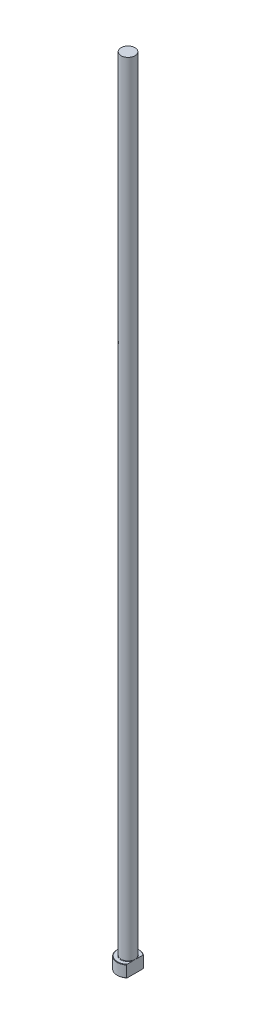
ISO-10303-21;
HEADER;
FILE_DESCRIPTION(('STEP AP214'),'2;1');
FILE_NAME('part.step','',(''),(''),'','','');
FILE_SCHEMA(('AUTOMOTIVE_DESIGN { 1 0 10303 214 1 1 1 1 }'));
ENDSEC;
DATA;
#1=APPLICATION_CONTEXT('core data for automotive mechanical design processes');
#2=APPLICATION_PROTOCOL_DEFINITION('international standard','automotive_design',2000,#1);
#3=PRODUCT_CONTEXT('',#1,'mechanical');
#4=PRODUCT('Part','Part','',(#3));
#5=PRODUCT_RELATED_PRODUCT_CATEGORY('part','',(#4));
#6=PRODUCT_DEFINITION_FORMATION('','',#4);
#7=PRODUCT_DEFINITION_CONTEXT('part definition',#1,'design');
#8=PRODUCT_DEFINITION('design','',#6,#7);
#9=PRODUCT_DEFINITION_SHAPE('','',#8);
#10=(LENGTH_UNIT() NAMED_UNIT(*) SI_UNIT(.MILLI.,.METRE.));
#11=(NAMED_UNIT(*) PLANE_ANGLE_UNIT() SI_UNIT($,.RADIAN.));
#12=(NAMED_UNIT(*) SI_UNIT($,.STERADIAN.) SOLID_ANGLE_UNIT());
#13=UNCERTAINTY_MEASURE_WITH_UNIT(LENGTH_MEASURE(1.E-05),#10,'distance_accuracy_value','');
#14=(GEOMETRIC_REPRESENTATION_CONTEXT(3) GLOBAL_UNCERTAINTY_ASSIGNED_CONTEXT((#13)) GLOBAL_UNIT_ASSIGNED_CONTEXT((#10,
#11,#12)) REPRESENTATION_CONTEXT('',''));
#15=CARTESIAN_POINT('',(0.,0.,0.));
#16=DIRECTION('',(0.,0.,1.));
#17=DIRECTION('',(1.,0.,0.));
#18=AXIS2_PLACEMENT_3D('',#15,#16,#17);
#19=CARTESIAN_POINT('',(0.,0.,0.));
#20=DIRECTION('',(0.,-1.,0.));
#21=DIRECTION('',(0.,0.,-1.));
#22=AXIS2_PLACEMENT_3D('',#19,#20,#21);
#23=PLANE('',#22);
#24=CARTESIAN_POINT('',(0.,0.,0.));
#25=DIRECTION('',(0.,-1.,0.));
#26=DIRECTION('',(0.,0.,-1.));
#27=AXIS2_PLACEMENT_3D('',#24,#25,#26);
#28=CIRCLE('',#27,5.30000000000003);
#29=CARTESIAN_POINT('',(3.49999999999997,0.,3.97994974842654));
#30=VERTEX_POINT('',#29);
#31=CARTESIAN_POINT('',(3.49999999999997,0.,-3.97994974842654));
#32=VERTEX_POINT('',#31);
#33=EDGE_CURVE('E98',#30,#32,#28,.T.);
#34=ORIENTED_EDGE('',*,*,#33,.T.);
#35=DIRECTION('',(0.,0.,1.));
#36=VECTOR('',#35,1.);
#37=CARTESIAN_POINT('',(3.49999999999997,0.,4.24264068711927));
#38=LINE('',#37,#36);
#39=EDGE_CURVE('E83',#32,#30,#38,.T.);
#40=ORIENTED_EDGE('',*,*,#39,.T.);
#41=EDGE_LOOP('',(#34,#40));
#42=FACE_BOUND('',#41,.T.);
#43=ADVANCED_FACE('F32',(#42),#23,.T.);
#44=CARTESIAN_POINT('',(0.,259.958771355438,0.));
#45=DIRECTION('',(0.,1.,0.));
#46=DIRECTION('',(0.,0.,1.));
#47=AXIS2_PLACEMENT_3D('',#44,#45,#46);
#48=CYLINDRICAL_SURFACE('',#47,5.49999999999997);
#49=CARTESIAN_POINT('',(0.,5.80000000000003,0.));
#50=DIRECTION('',(0.,1.,0.));
#51=DIRECTION('',(0.,0.,1.));
#52=AXIS2_PLACEMENT_3D('',#49,#50,#51);
#53=CIRCLE('',#52,5.49999999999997);
#54=CARTESIAN_POINT('',(3.49999999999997,5.80000000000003,4.24264068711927));
#55=VERTEX_POINT('',#54);
#56=CARTESIAN_POINT('',(3.49999999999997,5.80000000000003,-4.24264068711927));
#57=VERTEX_POINT('',#56);
#58=EDGE_CURVE('E104',#55,#57,#53,.F.);
#59=ORIENTED_EDGE('',*,*,#58,.T.);
#60=DIRECTION('',(0.,-1.,0.));
#61=VECTOR('',#60,1.);
#62=CARTESIAN_POINT('',(3.49999999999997,400.,-4.24264068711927));
#63=LINE('',#62,#61);
#64=CARTESIAN_POINT('',(3.49999999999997,0.199999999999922,-4.24264068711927));
#65=VERTEX_POINT('',#64);
#66=EDGE_CURVE('E183',#57,#65,#63,.T.);
#67=ORIENTED_EDGE('',*,*,#66,.T.);
#68=CARTESIAN_POINT('',(0.,0.199999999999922,0.));
#69=DIRECTION('',(0.,-1.,0.));
#70=DIRECTION('',(0.,0.,-1.));
#71=AXIS2_PLACEMENT_3D('',#68,#69,#70);
#72=CIRCLE('',#71,5.49999999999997);
#73=CARTESIAN_POINT('',(3.49999999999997,0.199999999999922,4.24264068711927));
#74=VERTEX_POINT('',#73);
#75=EDGE_CURVE('E100',#65,#74,#72,.F.);
#76=ORIENTED_EDGE('',*,*,#75,.T.);
#77=DIRECTION('',(0.,-1.,0.));
#78=VECTOR('',#77,1.);
#79=CARTESIAN_POINT('',(3.49999999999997,400.,4.24264068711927));
#80=LINE('',#79,#78);
#81=EDGE_CURVE('E93',#55,#74,#80,.T.);
#82=ORIENTED_EDGE('',*,*,#81,.F.);
#83=EDGE_LOOP('',(#59,#67,#76,#82));
#84=FACE_BOUND('',#83,.T.);
#85=ADVANCED_FACE('F158',(#84),#48,.T.);
#86=CARTESIAN_POINT('',(-5.49999999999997,6.,0.));
#87=DIRECTION('',(0.,1.,0.));
#88=DIRECTION('',(0.,0.,1.));
#89=AXIS2_PLACEMENT_3D('',#86,#87,#88);
#90=PLANE('',#89);
#91=CARTESIAN_POINT('',(0.,6.,0.));
#92=DIRECTION('',(0.,1.,0.));
#93=DIRECTION('',(0.,0.,1.));
#94=AXIS2_PLACEMENT_3D('',#91,#92,#93);
#95=CIRCLE('',#94,5.29999999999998);
#96=CARTESIAN_POINT('',(3.49999999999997,6.,-3.97994974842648));
#97=VERTEX_POINT('',#96);
#98=CARTESIAN_POINT('',(3.49999999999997,6.,3.97994974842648));
#99=VERTEX_POINT('',#98);
#100=EDGE_CURVE('E178',#97,#99,#95,.T.);
#101=ORIENTED_EDGE('',*,*,#100,.T.);
#102=DIRECTION('',(0.,0.,-1.));
#103=VECTOR('',#102,1.);
#104=CARTESIAN_POINT('',(3.49999999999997,6.,0.));
#105=LINE('',#104,#103);
#106=CARTESIAN_POINT('',(3.49999999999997,5.99999999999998,1.19999999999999));
#107=VERTEX_POINT('',#106);
#108=EDGE_CURVE('E57',#99,#107,#105,.T.);
#109=ORIENTED_EDGE('',*,*,#108,.T.);
#110=CARTESIAN_POINT('',(0.,6.,0.));
#111=DIRECTION('',(0.,1.,0.));
#112=DIRECTION('',(0.,0.,1.));
#113=AXIS2_PLACEMENT_3D('',#110,#111,#112);
#114=CIRCLE('',#113,3.69999999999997);
#115=CARTESIAN_POINT('',(3.49999999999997,5.99999999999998,-1.19999999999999));
#116=VERTEX_POINT('',#115);
#117=EDGE_CURVE('E107',#107,#116,#114,.F.);
#118=ORIENTED_EDGE('',*,*,#117,.T.);
#119=EDGE_CURVE('E136',#116,#97,#105,.T.);
#120=ORIENTED_EDGE('',*,*,#119,.T.);
#121=EDGE_LOOP('',(#101,#109,#118,#120));
#122=FACE_BOUND('',#121,.T.);
#123=ADVANCED_FACE('F147',(#122),#90,.T.);
#124=CARTESIAN_POINT('',(0.,6.00000000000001,0.));
#125=DIRECTION('',(0.,-1.,0.));
#126=DIRECTION('',(0.,0.,-1.));
#127=AXIS2_PLACEMENT_3D('',#124,#125,#126);
#128=CONICAL_SURFACE('',#127,5.29999999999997,0.785398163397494);
#129=ORIENTED_EDGE('',*,*,#58,.F.);
#130=CARTESIAN_POINT('',(3.49999999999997,1.33003849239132,9.33542352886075));
#131=CARTESIAN_POINT('',(3.49999999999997,1.46606755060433,9.19014587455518));
#132=CARTESIAN_POINT('',(3.49999999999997,1.60189091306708,9.04467563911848));
#133=CARTESIAN_POINT('',(3.49999999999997,1.87305939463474,8.75328845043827));
#134=CARTESIAN_POINT('',(3.49999999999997,2.00840451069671,8.60737149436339));
#135=CARTESIAN_POINT('',(3.49999999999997,2.41368868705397,8.16878624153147));
#136=CARTESIAN_POINT('',(3.49999999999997,2.68280695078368,7.87535778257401));
#137=CARTESIAN_POINT('',(3.49999999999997,3.22029202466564,7.28335275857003));
#138=CARTESIAN_POINT('',(3.49999999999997,3.4886340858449,6.9847536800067));
#139=CARTESIAN_POINT('',(3.49999999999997,4.02101445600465,6.38381794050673));
#140=CARTESIAN_POINT('',(3.49999999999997,4.28505346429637,6.08148190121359));
#141=CARTESIAN_POINT('',(3.49999999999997,4.76064644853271,5.52540485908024));
#142=CARTESIAN_POINT('',(3.49999999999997,4.97321621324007,5.27253724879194));
#143=CARTESIAN_POINT('',(3.49999999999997,5.28746532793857,4.88936279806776));
#144=CARTESIAN_POINT('',(3.49999999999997,5.39146981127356,4.76096380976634));
#145=CARTESIAN_POINT('',(3.49999999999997,5.5975686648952,4.50264388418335));
#146=CARTESIAN_POINT('',(3.49999999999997,5.69966308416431,4.3727229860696));
#147=CARTESIAN_POINT('',(3.49999999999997,5.90129005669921,4.11132273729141));
#148=CARTESIAN_POINT('',(3.49999999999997,6.00082737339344,3.97984706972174));
#149=CARTESIAN_POINT('',(3.49999999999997,6.19694716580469,3.71471559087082));
#150=CARTESIAN_POINT('',(3.49999999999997,6.29352983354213,3.58105992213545));
#151=CARTESIAN_POINT('',(3.49999999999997,6.48287386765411,3.31118530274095));
#152=CARTESIAN_POINT('',(3.49999999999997,6.57563763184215,3.17496804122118));
#153=CARTESIAN_POINT('',(3.49999999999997,6.75628267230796,2.89934683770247));
#154=CARTESIAN_POINT('',(3.49999999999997,6.84416488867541,2.75994351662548));
#155=CARTESIAN_POINT('',(3.49999999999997,6.99814457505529,2.50290457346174));
#156=CARTESIAN_POINT('',(3.49999999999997,7.06530217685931,2.3859068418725));
#157=CARTESIAN_POINT('',(3.49999999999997,7.19416460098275,2.14890235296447));
#158=CARTESIAN_POINT('',(3.49999999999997,7.25586874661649,2.02889522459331));
#159=CARTESIAN_POINT('',(3.49999999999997,7.37226286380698,1.78564087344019));
#160=CARTESIAN_POINT('',(3.49999999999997,7.42695969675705,1.66239696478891));
#161=CARTESIAN_POINT('',(3.49999999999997,7.52751976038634,1.41233625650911));
#162=CARTESIAN_POINT('',(3.49999999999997,7.57338548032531,1.28552047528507));
#163=CARTESIAN_POINT('',(3.49999999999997,7.64556102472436,1.05555158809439));
#164=CARTESIAN_POINT('',(3.49999999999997,7.67395518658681,0.953056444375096));
#165=CARTESIAN_POINT('',(3.49999999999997,7.72275092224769,0.7461912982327));
#166=CARTESIAN_POINT('',(3.49999999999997,7.7431553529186,0.641821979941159));
#167=CARTESIAN_POINT('',(3.49999999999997,7.77495944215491,0.43200211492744));
#168=CARTESIAN_POINT('',(3.49999999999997,7.78638437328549,0.326555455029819));
#169=CARTESIAN_POINT('',(3.49999999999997,7.79969943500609,0.115055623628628));
#170=CARTESIAN_POINT('',(3.49999999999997,7.80158992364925,0.00900247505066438));
#171=CARTESIAN_POINT('',(3.49999999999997,7.79572329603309,-0.202966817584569));
#172=CARTESIAN_POINT('',(3.49999999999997,7.78795394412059,-0.308882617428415));
#173=CARTESIAN_POINT('',(3.49999999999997,7.76318672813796,-0.519620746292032));
#174=CARTESIAN_POINT('',(3.49999999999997,7.74618811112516,-0.62444298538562));
#175=CARTESIAN_POINT('',(3.49999999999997,7.7037631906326,-0.832676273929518));
#176=CARTESIAN_POINT('',(3.49999999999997,7.67831139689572,-0.936082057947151));
#177=CARTESIAN_POINT('',(3.49999999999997,7.62008719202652,-1.14078653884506));
#178=CARTESIAN_POINT('',(3.49999999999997,7.58731462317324,-1.24208519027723));
#179=CARTESIAN_POINT('',(3.49999999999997,7.50935793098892,-1.45980073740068));
#180=CARTESIAN_POINT('',(3.49999999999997,7.46300722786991,-1.5757969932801));
#181=CARTESIAN_POINT('',(3.49999999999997,7.36341881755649,-1.80480236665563));
#182=CARTESIAN_POINT('',(3.49999999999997,7.31017881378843,-1.91781047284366));
#183=CARTESIAN_POINT('',(3.49999999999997,7.19809800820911,-2.14125149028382));
#184=CARTESIAN_POINT('',(3.49999999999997,7.13924715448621,-2.25167932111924));
#185=CARTESIAN_POINT('',(3.49999999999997,7.01714037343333,-2.47003557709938));
#186=CARTESIAN_POINT('',(3.49999999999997,6.95388506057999,-2.57796434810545));
#187=CARTESIAN_POINT('',(3.49999999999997,6.82298676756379,-2.79303108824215));
#188=CARTESIAN_POINT('',(3.49999999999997,6.75529770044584,-2.90014087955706));
#189=CARTESIAN_POINT('',(3.49999999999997,6.61696954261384,-3.11243359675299));
#190=CARTESIAN_POINT('',(3.49999999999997,6.54633037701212,-3.21761647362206));
#191=CARTESIAN_POINT('',(3.49999999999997,6.33097773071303,-3.53046033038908));
#192=CARTESIAN_POINT('',(3.49999999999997,6.18268185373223,-3.73565296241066));
#193=CARTESIAN_POINT('',(3.49999999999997,5.84686519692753,-4.18490965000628));
#194=CARTESIAN_POINT('',(3.49999999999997,5.65778936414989,-4.42779920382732));
#195=CARTESIAN_POINT('',(3.49999999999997,5.27320376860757,-4.90845921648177));
#196=CARTESIAN_POINT('',(3.49999999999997,5.07769298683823,-5.14622885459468));
#197=CARTESIAN_POINT('',(3.49999999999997,4.68199594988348,-5.61823063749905));
#198=CARTESIAN_POINT('',(3.49999999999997,4.48180526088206,-5.85245905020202));
#199=CARTESIAN_POINT('',(3.49999999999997,4.07816705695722,-6.31809464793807));
#200=CARTESIAN_POINT('',(3.49999999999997,3.87471946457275,-6.54950176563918));
#201=CARTESIAN_POINT('',(3.49999999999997,3.4780510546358,-6.99590528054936));
#202=CARTESIAN_POINT('',(3.49999999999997,3.2849759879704,-7.21103144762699));
#203=CARTESIAN_POINT('',(3.49999999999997,2.8971523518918,-7.63977694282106));
#204=CARTESIAN_POINT('',(3.49999999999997,2.70240374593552,-7.85339623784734));
#205=CARTESIAN_POINT('',(3.49999999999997,2.31198639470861,-8.27898344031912));
#206=CARTESIAN_POINT('',(3.49999999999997,2.11632036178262,-8.49095383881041));
#207=CARTESIAN_POINT('',(3.49999999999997,1.72392141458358,-8.91388826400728));
#208=CARTESIAN_POINT('',(3.49999999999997,1.52718854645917,-9.1248523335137));
#209=CARTESIAN_POINT('',(3.49999999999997,1.33003849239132,-9.33542352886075));
#210=B_SPLINE_CURVE_WITH_KNOTS('',3,(#130,#131,#132,#133,#134,#135,#136,#137,#138,#139,#140,
#141,#142,#143,#144,#145,#146,#147,#148,#149,#150,#151,#152,#153,#154,#155,#156,#157,#158,#159,
#160,#161,#162,#163,#164,#165,#166,#167,#168,#169,#170,#171,#172,#173,#174,#175,#176,#177,#178,
#179,#180,#181,#182,#183,#184,#185,#186,#187,#188,#189,#190,#191,#192,#193,#194,#195,#196,#197,
#198,#199,#200,#201,#202,#203,#204,#205,#206,#207,#208,#209),.UNSPECIFIED.,.F.,.F.,(4,2,2,2,2,2,
2,2,2,2,2,2,2,2,2,2,2,2,2,2,2,2,2,2,2,2,2,2,2,2,2,2,2,2,2,2,2,2,2,4),(0.,0.597063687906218,
1.19413116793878,2.38857142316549,3.59291920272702,4.79706926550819,5.78802649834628,
6.28372320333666,6.77940717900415,7.27408870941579,7.76873802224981,8.26307186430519,
8.75731017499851,9.16190479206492,9.56654954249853,9.97079499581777,10.3749263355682,
10.6937207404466,11.0124010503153,11.3301811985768,11.647949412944,11.9661205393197,
12.2843176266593,12.6034830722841,12.9226553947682,13.2971137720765,13.6716972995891,
14.0469649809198,14.4221804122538,14.8022378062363,15.1823048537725,15.9416042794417,
16.8648705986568,17.7882838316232,18.7126105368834,19.6369592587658,20.5041367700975,
21.37133326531,22.2367481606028,23.1021259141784),.UNSPECIFIED.);
#211=EDGE_CURVE('E135',#55,#99,#210,.T.);
#212=ORIENTED_EDGE('',*,*,#211,.T.);
#213=ORIENTED_EDGE('',*,*,#100,.F.);
#214=EDGE_CURVE('E127',#97,#57,#210,.T.);
#215=ORIENTED_EDGE('',*,*,#214,.T.);
#216=EDGE_LOOP('',(#129,#212,#213,#215));
#217=FACE_BOUND('',#216,.T.);
#218=ADVANCED_FACE('F143',(#217),#128,.T.);
#219=CARTESIAN_POINT('',(0.,0.199999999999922,0.));
#220=DIRECTION('',(0.,1.,0.));
#221=DIRECTION('',(0.,0.,1.));
#222=AXIS2_PLACEMENT_3D('',#219,#220,#221);
#223=CONICAL_SURFACE('',#222,5.49999999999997,0.785398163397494);
#224=ORIENTED_EDGE('',*,*,#75,.F.);
#225=CARTESIAN_POINT('',(3.49999999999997,4.66996150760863,-9.33542352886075));
#226=CARTESIAN_POINT('',(3.49999999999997,4.53393244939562,-9.19014587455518));
#227=CARTESIAN_POINT('',(3.49999999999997,4.39810908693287,-9.04467563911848));
#228=CARTESIAN_POINT('',(3.49999999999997,4.12694060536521,-8.75328845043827));
#229=CARTESIAN_POINT('',(3.49999999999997,3.99159548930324,-8.60737149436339));
#230=CARTESIAN_POINT('',(3.49999999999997,3.58631131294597,-8.16878624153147));
#231=CARTESIAN_POINT('',(3.49999999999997,3.31719304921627,-7.87535778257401));
#232=CARTESIAN_POINT('',(3.49999999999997,2.77970797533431,-7.28335275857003));
#233=CARTESIAN_POINT('',(3.49999999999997,2.51136591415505,-6.9847536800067));
#234=CARTESIAN_POINT('',(3.49999999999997,1.97898554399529,-6.38381794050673));
#235=CARTESIAN_POINT('',(3.49999999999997,1.71494653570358,-6.08148190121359));
#236=CARTESIAN_POINT('',(3.49999999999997,1.23935355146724,-5.52540485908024));
#237=CARTESIAN_POINT('',(3.49999999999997,1.02678378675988,-5.27253724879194));
#238=CARTESIAN_POINT('',(3.49999999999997,0.712534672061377,-4.88936279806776));
#239=CARTESIAN_POINT('',(3.49999999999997,0.608530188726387,-4.76096380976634));
#240=CARTESIAN_POINT('',(3.49999999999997,0.402431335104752,-4.50264388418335));
#241=CARTESIAN_POINT('',(3.49999999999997,0.300336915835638,-4.3727229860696));
#242=CARTESIAN_POINT('',(3.49999999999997,0.0987099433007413,-4.11132273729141));
#243=CARTESIAN_POINT('',(3.49999999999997,-0.000827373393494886,-3.97984706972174));
#244=CARTESIAN_POINT('',(3.49999999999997,-0.196947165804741,-3.71471559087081));
#245=CARTESIAN_POINT('',(3.49999999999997,-0.293529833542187,-3.58105992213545));
#246=CARTESIAN_POINT('',(3.49999999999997,-0.482873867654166,-3.31118530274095));
#247=CARTESIAN_POINT('',(3.49999999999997,-0.575637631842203,-3.17496804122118));
#248=CARTESIAN_POINT('',(3.49999999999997,-0.756282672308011,-2.89934683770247));
#249=CARTESIAN_POINT('',(3.49999999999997,-0.844164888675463,-2.75994351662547));
#250=CARTESIAN_POINT('',(3.49999999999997,-0.998144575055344,-2.50290457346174));
#251=CARTESIAN_POINT('',(3.49999999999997,-1.06530217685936,-2.38590684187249));
#252=CARTESIAN_POINT('',(3.49999999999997,-1.1941646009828,-2.14890235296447));
#253=CARTESIAN_POINT('',(3.49999999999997,-1.25586874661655,-2.0288952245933));
#254=CARTESIAN_POINT('',(3.49999999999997,-1.37226286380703,-1.78564087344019));
#255=CARTESIAN_POINT('',(3.49999999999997,-1.42695969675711,-1.66239696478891));
#256=CARTESIAN_POINT('',(3.49999999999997,-1.52751976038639,-1.4123362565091));
#257=CARTESIAN_POINT('',(3.49999999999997,-1.57338548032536,-1.28552047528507));
#258=CARTESIAN_POINT('',(3.49999999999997,-1.64556102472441,-1.05555158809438));
#259=CARTESIAN_POINT('',(3.49999999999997,-1.67395518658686,-0.953056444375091));
#260=CARTESIAN_POINT('',(3.49999999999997,-1.72275092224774,-0.746191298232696));
#261=CARTESIAN_POINT('',(3.49999999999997,-1.74315535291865,-0.641821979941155));
#262=CARTESIAN_POINT('',(3.49999999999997,-1.77495944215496,-0.432002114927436));
#263=CARTESIAN_POINT('',(3.49999999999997,-1.78638437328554,-0.326555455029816));
#264=CARTESIAN_POINT('',(3.49999999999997,-1.79969943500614,-0.115055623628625));
#265=CARTESIAN_POINT('',(3.49999999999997,-1.8015899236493,-0.00900247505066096));
#266=CARTESIAN_POINT('',(3.49999999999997,-1.79572329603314,0.202966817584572));
#267=CARTESIAN_POINT('',(3.49999999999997,-1.78795394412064,0.308882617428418));
#268=CARTESIAN_POINT('',(3.49999999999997,-1.76318672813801,0.519620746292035));
#269=CARTESIAN_POINT('',(3.49999999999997,-1.74618811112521,0.624442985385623));
#270=CARTESIAN_POINT('',(3.49999999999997,-1.70376319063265,0.83267627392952));
#271=CARTESIAN_POINT('',(3.49999999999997,-1.67831139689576,0.936082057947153));
#272=CARTESIAN_POINT('',(3.49999999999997,-1.62008719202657,1.14078653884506));
#273=CARTESIAN_POINT('',(3.49999999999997,-1.58731462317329,1.24208519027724));
#274=CARTESIAN_POINT('',(3.49999999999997,-1.50935793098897,1.45980073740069));
#275=CARTESIAN_POINT('',(3.49999999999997,-1.46300722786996,1.5757969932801));
#276=CARTESIAN_POINT('',(3.49999999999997,-1.36341881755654,1.80480236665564));
#277=CARTESIAN_POINT('',(3.49999999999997,-1.31017881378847,1.91781047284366));
#278=CARTESIAN_POINT('',(3.49999999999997,-1.19809800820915,2.14125149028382));
#279=CARTESIAN_POINT('',(3.49999999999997,-1.13924715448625,2.25167932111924));
#280=CARTESIAN_POINT('',(3.49999999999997,-1.01714037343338,2.47003557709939));
#281=CARTESIAN_POINT('',(3.49999999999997,-0.953885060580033,2.57796434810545));
#282=CARTESIAN_POINT('',(3.49999999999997,-0.822986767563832,2.79303108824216));
#283=CARTESIAN_POINT('',(3.49999999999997,-0.755297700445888,2.90014087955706));
#284=CARTESIAN_POINT('',(3.49999999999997,-0.616969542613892,3.112433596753));
#285=CARTESIAN_POINT('',(3.49999999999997,-0.546330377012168,3.21761647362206));
#286=CARTESIAN_POINT('',(3.49999999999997,-0.330977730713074,3.53046033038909));
#287=CARTESIAN_POINT('',(3.49999999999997,-0.182681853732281,3.73565296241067));
#288=CARTESIAN_POINT('',(3.49999999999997,0.153134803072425,4.18490965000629));
#289=CARTESIAN_POINT('',(3.49999999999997,0.342210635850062,4.42779920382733));
#290=CARTESIAN_POINT('',(3.49999999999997,0.726796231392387,4.90845921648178));
#291=CARTESIAN_POINT('',(3.49999999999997,0.922307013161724,5.14622885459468));
#292=CARTESIAN_POINT('',(3.49999999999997,1.31800405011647,5.61823063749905));
#293=CARTESIAN_POINT('',(3.49999999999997,1.5181947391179,5.85245905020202));
#294=CARTESIAN_POINT('',(3.49999999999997,1.92183294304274,6.31809464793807));
#295=CARTESIAN_POINT('',(3.49999999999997,2.1252805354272,6.54950176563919));
#296=CARTESIAN_POINT('',(3.49999999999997,2.52194894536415,6.99590528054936));
#297=CARTESIAN_POINT('',(3.49999999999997,2.71502401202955,7.21103144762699));
#298=CARTESIAN_POINT('',(3.49999999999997,3.10284764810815,7.63977694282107));
#299=CARTESIAN_POINT('',(3.49999999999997,3.29759625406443,7.85339623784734));
#300=CARTESIAN_POINT('',(3.49999999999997,3.68801360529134,8.27898344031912));
#301=CARTESIAN_POINT('',(3.49999999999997,3.88367963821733,8.49095383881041));
#302=CARTESIAN_POINT('',(3.49999999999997,4.27607858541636,8.91388826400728));
#303=CARTESIAN_POINT('',(3.49999999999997,4.47281145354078,9.1248523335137));
#304=CARTESIAN_POINT('',(3.49999999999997,4.66996150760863,9.33542352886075));
#305=B_SPLINE_CURVE_WITH_KNOTS('',3,(#225,#226,#227,#228,#229,#230,#231,#232,#233,#234,#235,
#236,#237,#238,#239,#240,#241,#242,#243,#244,#245,#246,#247,#248,#249,#250,#251,#252,#253,#254,
#255,#256,#257,#258,#259,#260,#261,#262,#263,#264,#265,#266,#267,#268,#269,#270,#271,#272,#273,
#274,#275,#276,#277,#278,#279,#280,#281,#282,#283,#284,#285,#286,#287,#288,#289,#290,#291,#292,
#293,#294,#295,#296,#297,#298,#299,#300,#301,#302,#303,#304),.UNSPECIFIED.,.F.,.F.,(4,2,2,2,2,2,
2,2,2,2,2,2,2,2,2,2,2,2,2,2,2,2,2,2,2,2,2,2,2,2,2,2,2,2,2,2,2,2,2,4),(0.,0.597063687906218,
1.19413116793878,2.38857142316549,3.59291920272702,4.79706926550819,5.78802649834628,
6.28372320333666,6.77940717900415,7.27408870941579,7.76873802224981,8.26307186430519,
8.75731017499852,9.16190479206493,9.56654954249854,9.97079499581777,10.3749263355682,
10.6937207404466,11.0124010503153,11.3301811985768,11.6479494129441,11.9661205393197,
12.2843176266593,12.6034830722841,12.9226553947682,13.2971137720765,13.6716972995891,
14.0469649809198,14.4221804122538,14.8022378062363,15.1823048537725,15.9416042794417,
16.8648705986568,17.7882838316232,18.7126105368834,19.6369592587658,20.5041367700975,
21.37133326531,22.2367481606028,23.1021259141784),.UNSPECIFIED.);
#306=EDGE_CURVE('E86',#65,#32,#305,.T.);
#307=ORIENTED_EDGE('',*,*,#306,.T.);
#308=ORIENTED_EDGE('',*,*,#33,.F.);
#309=EDGE_CURVE('E89',#30,#74,#305,.T.);
#310=ORIENTED_EDGE('',*,*,#309,.T.);
#311=EDGE_LOOP('',(#224,#307,#308,#310));
#312=FACE_BOUND('',#311,.T.);
#313=ADVANCED_FACE('F97',(#312),#223,.T.);
#314=CARTESIAN_POINT('',(0.,6.19999999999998,0.));
#315=DIRECTION('',(0.,1.,0.));
#316=DIRECTION('',(0.,0.,1.));
#317=AXIS2_PLACEMENT_3D('',#314,#315,#316);
#318=TOROIDAL_SURFACE('',#317,3.69999999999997,0.2);
#319=CARTESIAN_POINT('',(3.49999999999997,6.19999999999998,0.));
#320=CARTESIAN_POINT('',(3.49999999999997,6.20000050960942,9.98096063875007E-11));
#321=CARTESIAN_POINT('',(3.49999999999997,6.20000101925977,-2.13486746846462E-07));
#322=CARTESIAN_POINT('',(3.49999999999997,6.20000196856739,-7.95759128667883E-07));
#323=CARTESIAN_POINT('',(3.49999999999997,6.20000239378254,-1.1792583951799E-06));
#324=CARTESIAN_POINT('',(3.49999999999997,6.20000328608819,-2.10014972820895E-06));
#325=CARTESIAN_POINT('',(3.49999999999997,6.20000373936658,-2.65249908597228E-06));
#326=CARTESIAN_POINT('',(3.49999999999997,6.20000454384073,-3.79112889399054E-06));
#327=CARTESIAN_POINT('',(3.49999999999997,6.20000489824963,-4.37533521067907E-06));
#328=CARTESIAN_POINT('',(3.49999999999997,6.20000623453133,-6.66270059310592E-06));
#329=CARTESIAN_POINT('',(3.49999999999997,6.20000714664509,-8.40961025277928E-06));
#330=CARTESIAN_POINT('',(3.49999999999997,6.20000862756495,-1.18496824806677E-05));
#331=CARTESIAN_POINT('',(3.49999999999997,6.2000092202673,-1.35329548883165E-05));
#332=CARTESIAN_POINT('',(3.49999999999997,6.20001174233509,-2.07268950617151E-05));
#333=CARTESIAN_POINT('',(3.49999999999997,6.2000136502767,-2.62477536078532E-05));
#334=CARTESIAN_POINT('',(3.49999999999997,6.20001642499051,-3.66274572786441E-05));
#335=CARTESIAN_POINT('',(3.49999999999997,6.20001740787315,-4.14549355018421E-05));
#336=CARTESIAN_POINT('',(3.49999999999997,6.20002462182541,-7.75352102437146E-05));
#337=CARTESIAN_POINT('',(3.49999999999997,6.20003014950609,-0.000108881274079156));
#338=CARTESIAN_POINT('',(3.49999999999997,6.20005434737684,-0.000233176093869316));
#339=CARTESIAN_POINT('',(3.49999999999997,6.20007737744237,-0.000325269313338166));
#340=CARTESIAN_POINT('',(3.49999999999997,6.200167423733,-0.000691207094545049));
#341=CARTESIAN_POINT('',(3.49999999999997,6.20023166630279,-0.000965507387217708));
#342=CARTESIAN_POINT('',(3.49999999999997,6.20048971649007,-0.00205944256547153));
#343=CARTESIAN_POINT('',(3.49999999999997,6.20068705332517,-0.00287847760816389));
#344=CARTESIAN_POINT('',(3.49999999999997,6.20150941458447,-0.00630050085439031));
#345=CARTESIAN_POINT('',(3.49999999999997,6.2021299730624,-0.00890424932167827));
#346=CARTESIAN_POINT('',(3.49999999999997,6.20703918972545,-0.0294912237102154));
#347=CARTESIAN_POINT('',(3.49999999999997,6.21134300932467,-0.0474719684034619));
#348=CARTESIAN_POINT('',(3.49999999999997,6.21975360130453,-0.0827191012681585));
#349=CARTESIAN_POINT('',(3.49999999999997,6.22386136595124,-0.0999852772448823));
#350=CARTESIAN_POINT('',(3.49999999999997,6.23724019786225,-0.1564055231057));
#351=CARTESIAN_POINT('',(3.49999999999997,6.24645854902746,-0.195572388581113));
#352=CARTESIAN_POINT('',(3.49999999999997,6.26203234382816,-0.262828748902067));
#353=CARTESIAN_POINT('',(3.49999999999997,6.26845671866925,-0.2909022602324));
#354=CARTESIAN_POINT('',(3.49999999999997,6.28094671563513,-0.346379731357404));
#355=CARTESIAN_POINT('',(3.49999999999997,6.28701730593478,-0.373782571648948));
#356=CARTESIAN_POINT('',(3.49999999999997,6.30077691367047,-0.437211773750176));
#357=CARTESIAN_POINT('',(3.49999999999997,6.3083789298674,-0.473257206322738));
#358=CARTESIAN_POINT('',(3.49999999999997,6.32309409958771,-0.545736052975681));
#359=CARTESIAN_POINT('',(3.49999999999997,6.33020304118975,-0.582170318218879));
#360=CARTESIAN_POINT('',(3.49999999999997,6.35161649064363,-0.697757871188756));
#361=CARTESIAN_POINT('',(3.49999999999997,6.36463967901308,-0.777158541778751));
#362=CARTESIAN_POINT('',(3.49999999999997,6.3843837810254,-0.92756184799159));
#363=CARTESIAN_POINT('',(3.49999999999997,6.39165512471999,-0.998486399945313));
#364=CARTESIAN_POINT('',(3.49999999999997,6.3979989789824,-1.10437287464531));
#365=CARTESIAN_POINT('',(3.49999999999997,6.39936233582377,-1.13919451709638));
#366=CARTESIAN_POINT('',(3.49999999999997,6.40028946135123,-1.20885098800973));
#367=CARTESIAN_POINT('',(3.49999999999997,6.39985418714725,-1.24368579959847));
#368=CARTESIAN_POINT('',(3.49999999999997,6.39686573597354,-1.30963279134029));
#369=CARTESIAN_POINT('',(3.49999999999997,6.39453835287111,-1.34075403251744));
#370=CARTESIAN_POINT('',(3.49999999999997,6.38750048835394,-1.40298456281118));
#371=CARTESIAN_POINT('',(3.49999999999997,6.38277118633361,-1.43409178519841));
#372=CARTESIAN_POINT('',(3.49999999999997,6.37000596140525,-1.49609278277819));
#373=CARTESIAN_POINT('',(3.49999999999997,6.36193044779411,-1.52697933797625));
#374=CARTESIAN_POINT('',(3.49999999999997,6.34614337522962,-1.57192957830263));
#375=CARTESIAN_POINT('',(3.49999999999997,6.3402919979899,-1.5866404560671));
#376=CARTESIAN_POINT('',(3.49999999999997,6.32701491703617,-1.6153215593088));
#377=CARTESIAN_POINT('',(3.49999999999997,6.31959341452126,-1.6292936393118));
#378=CARTESIAN_POINT('',(3.49999999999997,6.30547056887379,-1.65150372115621));
#379=CARTESIAN_POINT('',(3.49999999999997,6.29934759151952,-1.6601058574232));
#380=CARTESIAN_POINT('',(3.49999999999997,6.28595656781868,-1.67637400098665));
#381=CARTESIAN_POINT('',(3.49999999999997,6.27869146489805,-1.68404232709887));
#382=CARTESIAN_POINT('',(3.49999999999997,6.26587375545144,-1.69518467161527));
#383=CARTESIAN_POINT('',(3.49999999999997,6.26073958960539,-1.69913647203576));
#384=CARTESIAN_POINT('',(3.49999999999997,6.24994100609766,-1.70624293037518));
#385=CARTESIAN_POINT('',(3.49999999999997,6.24427723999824,-1.70939855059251));
#386=CARTESIAN_POINT('',(3.49999999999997,6.23351378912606,-1.71418736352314));
#387=CARTESIAN_POINT('',(3.49999999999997,6.22849079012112,-1.71599090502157));
#388=CARTESIAN_POINT('',(3.49999999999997,6.21821361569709,-1.71873268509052));
#389=CARTESIAN_POINT('',(3.49999999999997,6.21295968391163,-1.71967181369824));
#390=CARTESIAN_POINT('',(3.49999999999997,6.20234462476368,-1.72059432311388));
#391=CARTESIAN_POINT('',(3.49999999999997,6.19698314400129,-1.72057373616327));
#392=CARTESIAN_POINT('',(3.49999999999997,6.18635093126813,-1.71956893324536));
#393=CARTESIAN_POINT('',(3.49999999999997,6.18108024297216,-1.71858426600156));
#394=CARTESIAN_POINT('',(3.49999999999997,6.17106869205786,-1.71582968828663));
#395=CARTESIAN_POINT('',(3.49999999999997,6.16631466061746,-1.71410641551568));
#396=CARTESIAN_POINT('',(3.49999999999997,6.15709718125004,-1.71001459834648));
#397=CARTESIAN_POINT('',(3.49999999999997,6.15263381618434,-1.70764587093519));
#398=CARTESIAN_POINT('',(3.49999999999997,6.14110717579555,-1.70060771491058));
#399=CARTESIAN_POINT('',(3.49999999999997,6.13433222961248,-1.69546710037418));
#400=CARTESIAN_POINT('',(3.49999999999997,6.12164557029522,-1.68420869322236));
#401=CARTESIAN_POINT('',(3.49999999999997,6.11573697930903,-1.67808752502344));
#402=CARTESIAN_POINT('',(3.49999999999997,6.10028952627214,-1.66008531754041));
#403=CARTESIAN_POINT('',(3.49999999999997,6.09159238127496,-1.64748936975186));
#404=CARTESIAN_POINT('',(3.49999999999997,6.07604019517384,-1.62125022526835));
#405=CARTESIAN_POINT('',(3.49999999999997,6.06918749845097,-1.60760572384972));
#406=CARTESIAN_POINT('',(3.49999999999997,6.05635908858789,-1.57851190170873));
#407=CARTESIAN_POINT('',(3.49999999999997,6.05050870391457,-1.56300807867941));
#408=CARTESIAN_POINT('',(3.49999999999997,6.04009412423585,-1.53156759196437));
#409=CARTESIAN_POINT('',(3.49999999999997,6.03553147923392,-1.51563043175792));
#410=CARTESIAN_POINT('',(3.49999999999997,6.02331191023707,-1.46712048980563));
#411=CARTESIAN_POINT('',(3.49999999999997,6.01724153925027,-1.4341495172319));
#412=CARTESIAN_POINT('',(3.49999999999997,6.00883071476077,-1.37348993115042));
#413=CARTESIAN_POINT('',(3.49999999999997,6.00603148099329,-1.34585663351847));
#414=CARTESIAN_POINT('',(3.49999999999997,6.00204762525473,-1.29046925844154));
#415=CARTESIAN_POINT('',(3.49999999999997,6.00086336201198,-1.26271515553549));
#416=CARTESIAN_POINT('',(3.49999999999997,5.99925913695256,-1.17922229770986));
#417=CARTESIAN_POINT('',(3.49999999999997,6.00080993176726,-1.1234488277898));
#418=CARTESIAN_POINT('',(3.49999999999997,6.00738569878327,-1.01528124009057));
#419=CARTESIAN_POINT('',(3.49999999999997,6.01221131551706,-0.962872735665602));
#420=CARTESIAN_POINT('',(3.49999999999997,6.02425367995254,-0.858750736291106));
#421=CARTESIAN_POINT('',(3.49999999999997,6.03145152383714,-0.807035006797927));
#422=CARTESIAN_POINT('',(3.49999999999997,6.04786442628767,-0.702500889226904));
#423=CARTESIAN_POINT('',(3.49999999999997,6.05712869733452,-0.649690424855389));
#424=CARTESIAN_POINT('',(3.49999999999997,6.07730630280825,-0.542969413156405));
#425=CARTESIAN_POINT('',(3.49999999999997,6.08825618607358,-0.489065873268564));
#426=CARTESIAN_POINT('',(3.49999999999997,6.10770336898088,-0.397738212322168));
#427=CARTESIAN_POINT('',(3.49999999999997,6.11594150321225,-0.360258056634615));
#428=CARTESIAN_POINT('',(3.49999999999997,6.13268124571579,-0.285797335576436));
#429=CARTESIAN_POINT('',(3.49999999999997,6.14117887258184,-0.248815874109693));
#430=CARTESIAN_POINT('',(3.49999999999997,6.15740628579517,-0.179140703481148));
#431=CARTESIAN_POINT('',(3.49999999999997,6.16511243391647,-0.146441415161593));
#432=CARTESIAN_POINT('',(3.49999999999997,6.18096853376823,-0.0796648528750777));
#433=CARTESIAN_POINT('',(3.49999999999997,6.18912333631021,-0.0455886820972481));
#434=CARTESIAN_POINT('',(3.49999999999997,6.19787118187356,-0.00889903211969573));
#435=CARTESIAN_POINT('',(3.49999999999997,6.19849305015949,-0.00629009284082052));
#436=CARTESIAN_POINT('',(3.49999999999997,6.19931571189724,-0.00286690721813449));
#437=CARTESIAN_POINT('',(3.49999999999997,6.19951207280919,-0.00205190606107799));
#438=CARTESIAN_POINT('',(3.49999999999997,6.19976893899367,-0.000962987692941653));
#439=CARTESIAN_POINT('',(3.49999999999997,6.19983295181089,-0.000689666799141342));
#440=CARTESIAN_POINT('',(3.49999999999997,6.19992272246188,-0.000324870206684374));
#441=CARTESIAN_POINT('',(3.49999999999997,6.19994571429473,-0.000232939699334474));
#442=CARTESIAN_POINT('',(3.49999999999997,6.19996987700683,-0.000108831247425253));
#443=CARTESIAN_POINT('',(3.49999999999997,6.1999754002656,-7.75074375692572E-05));
#444=CARTESIAN_POINT('',(3.49999999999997,6.199982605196,-4.14499502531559E-05));
#445=CARTESIAN_POINT('',(3.49999999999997,6.19998358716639,-3.66236562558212E-05));
#446=CARTESIAN_POINT('',(3.49999999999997,6.19998635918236,-2.62464271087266E-05));
#447=CARTESIAN_POINT('',(3.49999999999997,6.1999882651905,-2.07267962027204E-05));
#448=CARTESIAN_POINT('',(3.49999999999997,6.19999078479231,-1.35341428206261E-05));
#449=CARTESIAN_POINT('',(3.49999999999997,6.19999137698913,-1.18509583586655E-05));
#450=CARTESIAN_POINT('',(3.49999999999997,6.19999285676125,-8.41098341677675E-06));
#451=CARTESIAN_POINT('',(3.49999999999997,6.19999376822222,-6.66407126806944E-06));
#452=CARTESIAN_POINT('',(3.49999999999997,6.19999510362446,-4.37661194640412E-06));
#453=CARTESIAN_POINT('',(3.49999999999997,6.1999954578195,-3.79235333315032E-06));
#454=CARTESIAN_POINT('',(3.49999999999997,6.19999626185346,-2.65358032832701E-06));
#455=CARTESIAN_POINT('',(3.49999999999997,6.19999671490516,-2.10113839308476E-06));
#456=CARTESIAN_POINT('',(3.49999999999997,6.1999976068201,-1.180031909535E-06));
#457=CARTESIAN_POINT('',(3.49999999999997,6.19999803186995,-7.9641876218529E-07));
#458=CARTESIAN_POINT('',(3.49999999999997,6.19999898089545,-2.13855188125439E-07));
#459=CARTESIAN_POINT('',(3.49999999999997,6.19999949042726,-9.98024170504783E-11));
#460=CARTESIAN_POINT('',(3.49999999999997,6.19999999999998,0.));
#461=B_SPLINE_CURVE_WITH_KNOTS('',3,(#319,#320,#321,#322,#323,#324,#325,#326,#327,#328,#329,
#330,#331,#332,#333,#334,#335,#336,#337,#338,#339,#340,#341,#342,#343,#344,#345,#346,#347,#348,
#349,#350,#351,#352,#353,#354,#355,#356,#357,#358,#359,#360,#361,#362,#363,#364,#365,#366,#367,
#368,#369,#370,#371,#372,#373,#374,#375,#376,#377,#378,#379,#380,#381,#382,#383,#384,#385,#386,
#387,#388,#389,#390,#391,#392,#393,#394,#395,#396,#397,#398,#399,#400,#401,#402,#403,#404,#405,
#406,#407,#408,#409,#410,#411,#412,#413,#414,#415,#416,#417,#418,#419,#420,#421,#422,#423,#424,
#425,#426,#427,#428,#429,#430,#431,#432,#433,#434,#435,#436,#437,#438,#439,#440,#441,#442,#443,
#444,#445,#446,#447,#448,#449,#450,#451,#452,#453,#454,#455,#456,#457,#458,#459,#460),
.UNSPECIFIED.,.T.,.F.,(4,2,2,2,2,2,2,2,2,2,2,2,2,2,2,2,2,2,2,2,2,2,2,2,2,2,2,2,2,2,2,2,2,2,2,2,
2,2,2,2,2,2,2,2,2,2,2,2,2,2,2,2,2,2,2,2,2,2,2,2,2,2,2,2,2,2,2,2,2,2,4),(0.,1.54778905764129E-06,
3.27068857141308E-06,5.40032148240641E-06,7.44938902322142E-06,1.3341290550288E-05,
1.86900588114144E-05,3.61865045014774E-05,5.0948802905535E-05,0.000146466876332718,
0.000431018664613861,0.00127643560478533,0.00380354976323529,0.0118339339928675,
0.0672984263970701,0.120543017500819,0.241253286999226,0.327650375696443,0.411851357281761,
0.522362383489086,0.633723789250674,0.875007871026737,1.08869711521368,1.19320699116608,
1.29766126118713,1.39121331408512,1.4855099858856,1.58095571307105,1.62839133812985,
1.67570160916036,1.70731126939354,1.73884076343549,1.7582242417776,1.77758417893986,
1.79352969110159,1.80945876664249,1.82545370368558,1.84145613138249,1.8565700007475,
1.87168815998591,1.89705349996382,1.92250811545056,1.96816999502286,2.01388964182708,
2.06352392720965,2.11321770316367,2.21356505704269,2.29684564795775,2.38014473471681,
2.54733140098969,2.70515844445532,2.86175703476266,3.02258329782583,3.18758220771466,
3.30270498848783,3.41653913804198,3.51732480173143,3.62243689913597,3.63048332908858,
3.63299799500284,3.63384039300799,3.63412444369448,3.6342198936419,3.63423465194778,
3.63425214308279,3.63425749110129,3.63426338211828,3.63426543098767,3.63426756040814,
3.63426928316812,3.63427083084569),.UNSPECIFIED.);
#462=CARTESIAN_POINT('',(3.49999999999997,6.19999999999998,0.));
#463=VERTEX_POINT('',#462);
#464=EDGE_CURVE('E11',#116,#463,#461,.T.);
#465=ORIENTED_EDGE('',*,*,#464,.F.);
#466=ORIENTED_EDGE('',*,*,#117,.F.);
#467=CARTESIAN_POINT('',(3.49999999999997,6.19999999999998,0.));
#468=CARTESIAN_POINT('',(3.49999999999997,6.19999949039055,-9.98096571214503E-11));
#469=CARTESIAN_POINT('',(3.49999999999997,6.19999898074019,2.13486746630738E-07));
#470=CARTESIAN_POINT('',(3.49999999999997,6.19999803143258,7.95759128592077E-07));
#471=CARTESIAN_POINT('',(3.49999999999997,6.19999760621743,1.17925839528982E-06));
#472=CARTESIAN_POINT('',(3.49999999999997,6.19999671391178,2.10014972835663E-06));
#473=CARTESIAN_POINT('',(3.49999999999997,6.19999626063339,2.65249908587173E-06));
#474=CARTESIAN_POINT('',(3.49999999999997,6.19999545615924,3.79112889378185E-06));
#475=CARTESIAN_POINT('',(3.49999999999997,6.19999510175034,4.37533521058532E-06));
#476=CARTESIAN_POINT('',(3.49999999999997,6.19999376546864,6.66270059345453E-06));
#477=CARTESIAN_POINT('',(3.49999999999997,6.19999285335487,8.40961025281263E-06));
#478=CARTESIAN_POINT('',(3.49999999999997,6.19999137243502,1.18496824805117E-05));
#479=CARTESIAN_POINT('',(3.49999999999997,6.19999077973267,1.35329548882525E-05));
#480=CARTESIAN_POINT('',(3.49999999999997,6.19998825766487,2.0726895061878E-05));
#481=CARTESIAN_POINT('',(3.49999999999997,6.19998634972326,2.62477536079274E-05));
#482=CARTESIAN_POINT('',(3.49999999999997,6.19998357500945,3.66274572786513E-05));
#483=CARTESIAN_POINT('',(3.49999999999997,6.19998259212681,4.14549355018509E-05));
#484=CARTESIAN_POINT('',(3.49999999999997,6.19997537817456,7.75352102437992E-05));
#485=CARTESIAN_POINT('',(3.49999999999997,6.19996985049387,0.000108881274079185));
#486=CARTESIAN_POINT('',(3.49999999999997,6.19994565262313,0.000233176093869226));
#487=CARTESIAN_POINT('',(3.49999999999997,6.1999226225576,0.000325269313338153));
#488=CARTESIAN_POINT('',(3.49999999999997,6.19983257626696,0.000691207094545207));
#489=CARTESIAN_POINT('',(3.49999999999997,6.19976833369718,0.000965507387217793));
#490=CARTESIAN_POINT('',(3.49999999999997,6.1995102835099,0.00205944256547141));
#491=CARTESIAN_POINT('',(3.49999999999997,6.1993129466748,0.00287847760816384));
#492=CARTESIAN_POINT('',(3.49999999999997,6.1984905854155,0.00630050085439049));
#493=CARTESIAN_POINT('',(3.49999999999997,6.19787002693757,0.00890424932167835));
#494=CARTESIAN_POINT('',(3.49999999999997,6.19296081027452,0.0294912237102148));
#495=CARTESIAN_POINT('',(3.49999999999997,6.1886569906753,0.0474719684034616));
#496=CARTESIAN_POINT('',(3.49999999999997,6.18024639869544,0.0827191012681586));
#497=CARTESIAN_POINT('',(3.49999999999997,6.17613863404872,0.0999852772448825));
#498=CARTESIAN_POINT('',(3.49999999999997,6.16275980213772,0.1564055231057));
#499=CARTESIAN_POINT('',(3.49999999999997,6.1535414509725,0.195572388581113));
#500=CARTESIAN_POINT('',(3.49999999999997,6.13796765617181,0.262828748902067));
#501=CARTESIAN_POINT('',(3.49999999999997,6.13154328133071,0.2909022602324));
#502=CARTESIAN_POINT('',(3.49999999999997,6.11905328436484,0.346379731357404));
#503=CARTESIAN_POINT('',(3.49999999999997,6.11298269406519,0.373782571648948));
#504=CARTESIAN_POINT('',(3.49999999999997,6.09922308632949,0.437211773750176));
#505=CARTESIAN_POINT('',(3.49999999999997,6.09162107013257,0.473257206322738));
#506=CARTESIAN_POINT('',(3.49999999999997,6.07690590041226,0.545736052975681));
#507=CARTESIAN_POINT('',(3.49999999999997,6.06979695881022,0.582170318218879));
#508=CARTESIAN_POINT('',(3.49999999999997,6.04838350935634,0.697757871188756));
#509=CARTESIAN_POINT('',(3.49999999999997,6.03536032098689,0.777158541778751));
#510=CARTESIAN_POINT('',(3.49999999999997,6.01561621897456,0.92756184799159));
#511=CARTESIAN_POINT('',(3.49999999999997,6.00834487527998,0.998486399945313));
#512=CARTESIAN_POINT('',(3.49999999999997,6.00200102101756,1.10437287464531));
#513=CARTESIAN_POINT('',(3.49999999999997,6.00063766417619,1.13919451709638));
#514=CARTESIAN_POINT('',(3.49999999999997,5.99971053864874,1.20885098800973));
#515=CARTESIAN_POINT('',(3.49999999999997,6.00014581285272,1.24368579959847));
#516=CARTESIAN_POINT('',(3.49999999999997,6.00313426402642,1.30963279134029));
#517=CARTESIAN_POINT('',(3.49999999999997,6.00546164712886,1.34075403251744));
#518=CARTESIAN_POINT('',(3.49999999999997,6.01249951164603,1.40298456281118));
#519=CARTESIAN_POINT('',(3.49999999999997,6.01722881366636,1.43409178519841));
#520=CARTESIAN_POINT('',(3.49999999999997,6.02999403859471,1.49609278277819));
#521=CARTESIAN_POINT('',(3.49999999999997,6.03806955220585,1.52697933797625));
#522=CARTESIAN_POINT('',(3.49999999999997,6.05385662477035,1.57192957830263));
#523=CARTESIAN_POINT('',(3.49999999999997,6.05970800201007,1.5866404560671));
#524=CARTESIAN_POINT('',(3.49999999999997,6.0729850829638,1.6153215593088));
#525=CARTESIAN_POINT('',(3.49999999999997,6.0804065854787,1.6292936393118));
#526=CARTESIAN_POINT('',(3.49999999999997,6.09452943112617,1.65150372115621));
#527=CARTESIAN_POINT('',(3.49999999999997,6.10065240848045,1.6601058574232));
#528=CARTESIAN_POINT('',(3.49999999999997,6.11404343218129,1.67637400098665));
#529=CARTESIAN_POINT('',(3.49999999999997,6.12130853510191,1.68404232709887));
#530=CARTESIAN_POINT('',(3.49999999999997,6.13412624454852,1.69518467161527));
#531=CARTESIAN_POINT('',(3.49999999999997,6.13926041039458,1.69913647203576));
#532=CARTESIAN_POINT('',(3.49999999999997,6.1500589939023,1.70624293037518));
#533=CARTESIAN_POINT('',(3.49999999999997,6.15572276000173,1.70939855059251));
#534=CARTESIAN_POINT('',(3.49999999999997,6.1664862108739,1.71418736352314));
#535=CARTESIAN_POINT('',(3.49999999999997,6.17150920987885,1.71599090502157));
#536=CARTESIAN_POINT('',(3.49999999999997,6.18178638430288,1.71873268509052));
#537=CARTESIAN_POINT('',(3.49999999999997,6.18704031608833,1.71967181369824));
#538=CARTESIAN_POINT('',(3.49999999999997,6.19765537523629,1.72059432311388));
#539=CARTESIAN_POINT('',(3.49999999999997,6.20301685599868,1.72057373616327));
#540=CARTESIAN_POINT('',(3.49999999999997,6.21364906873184,1.71956893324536));
#541=CARTESIAN_POINT('',(3.49999999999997,6.21891975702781,1.71858426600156));
#542=CARTESIAN_POINT('',(3.49999999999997,6.22893130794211,1.71582968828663));
#543=CARTESIAN_POINT('',(3.49999999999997,6.23368533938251,1.71410641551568));
#544=CARTESIAN_POINT('',(3.49999999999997,6.24290281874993,1.71001459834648));
#545=CARTESIAN_POINT('',(3.49999999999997,6.24736618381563,1.70764587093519));
#546=CARTESIAN_POINT('',(3.49999999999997,6.25889282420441,1.70060771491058));
#547=CARTESIAN_POINT('',(3.49999999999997,6.26566777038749,1.69546710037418));
#548=CARTESIAN_POINT('',(3.49999999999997,6.27835442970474,1.68420869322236));
#549=CARTESIAN_POINT('',(3.49999999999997,6.28426302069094,1.67808752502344));
#550=CARTESIAN_POINT('',(3.49999999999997,6.29971047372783,1.66008531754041));
#551=CARTESIAN_POINT('',(3.49999999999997,6.30840761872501,1.64748936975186));
#552=CARTESIAN_POINT('',(3.49999999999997,6.32395980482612,1.62125022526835));
#553=CARTESIAN_POINT('',(3.49999999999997,6.33081250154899,1.60760572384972));
#554=CARTESIAN_POINT('',(3.49999999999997,6.34364091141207,1.57851190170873));
#555=CARTESIAN_POINT('',(3.49999999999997,6.3494912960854,1.56300807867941));
#556=CARTESIAN_POINT('',(3.49999999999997,6.35990587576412,1.53156759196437));
#557=CARTESIAN_POINT('',(3.49999999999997,6.36446852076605,1.51563043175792));
#558=CARTESIAN_POINT('',(3.49999999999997,6.37668808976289,1.46712048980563));
#559=CARTESIAN_POINT('',(3.49999999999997,6.3827584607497,1.4341495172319));
#560=CARTESIAN_POINT('',(3.49999999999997,6.3911692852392,1.37348993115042));
#561=CARTESIAN_POINT('',(3.49999999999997,6.39396851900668,1.34585663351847));
#562=CARTESIAN_POINT('',(3.49999999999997,6.39795237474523,1.29046925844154));
#563=CARTESIAN_POINT('',(3.49999999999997,6.39913663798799,1.26271515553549));
#564=CARTESIAN_POINT('',(3.49999999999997,6.40074086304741,1.17922229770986));
#565=CARTESIAN_POINT('',(3.49999999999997,6.3991900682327,1.1234488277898));
#566=CARTESIAN_POINT('',(3.49999999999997,6.39261430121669,1.01528124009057));
#567=CARTESIAN_POINT('',(3.49999999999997,6.3877886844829,0.962872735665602));
#568=CARTESIAN_POINT('',(3.49999999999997,6.37574632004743,0.858750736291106));
#569=CARTESIAN_POINT('',(3.49999999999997,6.36854847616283,0.807035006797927));
#570=CARTESIAN_POINT('',(3.49999999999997,6.3521355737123,0.702500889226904));
#571=CARTESIAN_POINT('',(3.49999999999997,6.34287130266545,0.649690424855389));
#572=CARTESIAN_POINT('',(3.49999999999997,6.32269369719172,0.542969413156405));
#573=CARTESIAN_POINT('',(3.49999999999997,6.31174381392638,0.489065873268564));
#574=CARTESIAN_POINT('',(3.49999999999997,6.29229663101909,0.397738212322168));
#575=CARTESIAN_POINT('',(3.49999999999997,6.28405849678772,0.360258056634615));
#576=CARTESIAN_POINT('',(3.49999999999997,6.26731875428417,0.285797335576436));
#577=CARTESIAN_POINT('',(3.49999999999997,6.25882112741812,0.248815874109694));
#578=CARTESIAN_POINT('',(3.49999999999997,6.2425937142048,0.179140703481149));
#579=CARTESIAN_POINT('',(3.49999999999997,6.2348875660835,0.146441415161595));
#580=CARTESIAN_POINT('',(3.49999999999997,6.21903146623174,0.0796648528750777));
#581=CARTESIAN_POINT('',(3.49999999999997,6.21087666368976,0.0455886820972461));
#582=CARTESIAN_POINT('',(3.49999999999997,6.20212881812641,0.00889903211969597));
#583=CARTESIAN_POINT('',(3.49999999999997,6.20150694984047,0.00629009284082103));
#584=CARTESIAN_POINT('',(3.49999999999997,6.20068428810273,0.0028669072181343));
#585=CARTESIAN_POINT('',(3.49999999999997,6.20048792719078,0.00205190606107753));
#586=CARTESIAN_POINT('',(3.49999999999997,6.2002310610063,0.000962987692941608));
#587=CARTESIAN_POINT('',(3.49999999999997,6.20016704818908,0.000689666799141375));
#588=CARTESIAN_POINT('',(3.49999999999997,6.20007727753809,0.000324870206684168));
#589=CARTESIAN_POINT('',(3.49999999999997,6.20005428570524,0.000232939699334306));
#590=CARTESIAN_POINT('',(3.49999999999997,6.20003012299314,0.000108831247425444));
#591=CARTESIAN_POINT('',(3.49999999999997,6.20002459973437,7.75074375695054E-05));
#592=CARTESIAN_POINT('',(3.49999999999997,6.20001739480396,4.14499502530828E-05));
#593=CARTESIAN_POINT('',(3.49999999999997,6.20001641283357,3.6623656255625E-05));
#594=CARTESIAN_POINT('',(3.49999999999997,6.20001364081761,2.62464271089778E-05));
#595=CARTESIAN_POINT('',(3.49999999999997,6.20001173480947,2.07267962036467E-05));
#596=CARTESIAN_POINT('',(3.49999999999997,6.20000921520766,1.35341428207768E-05));
#597=CARTESIAN_POINT('',(3.49999999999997,6.20000862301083,1.18509583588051E-05));
#598=CARTESIAN_POINT('',(3.49999999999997,6.20000714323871,8.41098341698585E-06));
#599=CARTESIAN_POINT('',(3.49999999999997,6.20000623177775,6.66407126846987E-06));
#600=CARTESIAN_POINT('',(3.49999999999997,6.2000048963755,4.37661194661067E-06));
#601=CARTESIAN_POINT('',(3.49999999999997,6.20000454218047,3.79235333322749E-06));
#602=CARTESIAN_POINT('',(3.49999999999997,6.2000037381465,2.65358032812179E-06));
#603=CARTESIAN_POINT('',(3.49999999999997,6.20000328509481,2.10113839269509E-06));
#604=CARTESIAN_POINT('',(3.49999999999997,6.20000239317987,1.18003190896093E-06));
#605=CARTESIAN_POINT('',(3.49999999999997,6.20000196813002,7.96418761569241E-07));
#606=CARTESIAN_POINT('',(3.49999999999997,6.20000101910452,2.13855187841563E-07));
#607=CARTESIAN_POINT('',(3.49999999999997,6.20000050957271,9.98024677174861E-11));
#608=CARTESIAN_POINT('',(3.49999999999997,6.19999999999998,0.));
#609=B_SPLINE_CURVE_WITH_KNOTS('',3,(#467,#468,#469,#470,#471,#472,#473,#474,#475,#476,#477,
#478,#479,#480,#481,#482,#483,#484,#485,#486,#487,#488,#489,#490,#491,#492,#493,#494,#495,#496,
#497,#498,#499,#500,#501,#502,#503,#504,#505,#506,#507,#508,#509,#510,#511,#512,#513,#514,#515,
#516,#517,#518,#519,#520,#521,#522,#523,#524,#525,#526,#527,#528,#529,#530,#531,#532,#533,#534,
#535,#536,#537,#538,#539,#540,#541,#542,#543,#544,#545,#546,#547,#548,#549,#550,#551,#552,#553,
#554,#555,#556,#557,#558,#559,#560,#561,#562,#563,#564,#565,#566,#567,#568,#569,#570,#571,#572,
#573,#574,#575,#576,#577,#578,#579,#580,#581,#582,#583,#584,#585,#586,#587,#588,#589,#590,#591,
#592,#593,#594,#595,#596,#597,#598,#599,#600,#601,#602,#603,#604,#605,#606,#607,#608),
.UNSPECIFIED.,.T.,.F.,(4,2,2,2,2,2,2,2,2,2,2,2,2,2,2,2,2,2,2,2,2,2,2,2,2,2,2,2,2,2,2,2,2,2,2,2,
2,2,2,2,2,2,2,2,2,2,2,2,2,2,2,2,2,2,2,2,2,2,2,2,2,2,2,2,2,2,2,2,2,2,4),(0.,1.54778905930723E-06,
3.27068857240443E-06,5.40032148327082E-06,7.44938902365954E-06,1.33412905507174E-05,
1.86900588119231E-05,3.61865045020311E-05,5.09488029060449E-05,0.000146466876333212,
0.000431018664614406,0.00127643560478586,0.00380354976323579,0.011833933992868,
0.0672984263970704,0.120543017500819,0.241253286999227,0.327650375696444,0.411851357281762,
0.522362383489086,0.633723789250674,0.875007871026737,1.08869711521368,1.19320699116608,
1.29766126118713,1.39121331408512,1.4855099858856,1.58095571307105,1.62839133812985,
1.67570160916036,1.70731126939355,1.73884076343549,1.7582242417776,1.77758417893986,
1.79352969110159,1.80945876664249,1.82545370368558,1.84145613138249,1.8565700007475,
1.87168815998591,1.89705349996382,1.92250811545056,1.96816999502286,2.01388964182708,
2.06352392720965,2.11321770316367,2.21356505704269,2.29684564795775,2.38014473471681,
2.5473314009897,2.70515844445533,2.86175703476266,3.02258329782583,3.18758220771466,
3.30270498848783,3.41653913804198,3.51732480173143,3.62243689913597,3.63048332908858,
3.63299799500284,3.63384039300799,3.63412444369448,3.6342198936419,3.63423465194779,
3.63425214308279,3.63425749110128,3.63426338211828,3.63426543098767,3.63426756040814,
3.63426928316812,3.63427083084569),.UNSPECIFIED.);
#610=EDGE_CURVE('E46',#463,#107,#609,.T.);
#611=ORIENTED_EDGE('',*,*,#610,.F.);
#612=CARTESIAN_POINT('',(0.,6.19999999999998,0.));
#613=DIRECTION('',(0.,1.,0.));
#614=DIRECTION('',(0.,0.,1.));
#615=AXIS2_PLACEMENT_3D('',#612,#613,#614);
#616=CIRCLE('',#615,3.49999999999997);
#617=EDGE_CURVE('E103',#463,#463,#616,.T.);
#618=ORIENTED_EDGE('',*,*,#617,.F.);
#619=EDGE_LOOP('',(#465,#466,#611,#618));
#620=FACE_BOUND('',#619,.T.);
#621=ADVANCED_FACE('F34',(#620),#318,.F.);
#622=CARTESIAN_POINT('',(0.,259.958771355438,0.));
#623=DIRECTION('',(0.,1.,0.));
#624=DIRECTION('',(0.,0.,1.));
#625=AXIS2_PLACEMENT_3D('',#622,#623,#624);
#626=CYLINDRICAL_SURFACE('',#625,3.49999999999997);
#627=ORIENTED_EDGE('',*,*,#617,.T.);
#628=EDGE_LOOP('',(#627));
#629=FACE_BOUND('',#628,.T.);
#630=CARTESIAN_POINT('',(0.,400.,0.));
#631=DIRECTION('',(0.,1.,0.));
#632=DIRECTION('',(0.,0.,1.));
#633=AXIS2_PLACEMENT_3D('',#630,#631,#632);
#634=CIRCLE('',#633,3.49999999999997);
#635=CARTESIAN_POINT('',(0.,400.,3.49999999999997));
#636=VERTEX_POINT('',#635);
#637=EDGE_CURVE('E101',#636,#636,#634,.T.);
#638=ORIENTED_EDGE('',*,*,#637,.F.);
#639=EDGE_LOOP('',(#638));
#640=FACE_BOUND('',#639,.T.);
#641=ADVANCED_FACE('F155',(#629,#640),#626,.T.);
#642=CARTESIAN_POINT('',(-3.49999999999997,400.,0.));
#643=DIRECTION('',(0.,1.,0.));
#644=DIRECTION('',(0.,0.,1.));
#645=AXIS2_PLACEMENT_3D('',#642,#643,#644);
#646=PLANE('',#645);
#647=ORIENTED_EDGE('',*,*,#637,.T.);
#648=EDGE_LOOP('',(#647));
#649=FACE_BOUND('',#648,.T.);
#650=ADVANCED_FACE('F121',(#649),#646,.T.);
#651=CARTESIAN_POINT('',(3.49999999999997,400.,4.24264068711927));
#652=DIRECTION('',(1.,0.,0.));
#653=DIRECTION('',(0.,0.,-1.));
#654=AXIS2_PLACEMENT_3D('',#651,#652,#653);
#655=PLANE('',#654);
#656=ORIENTED_EDGE('',*,*,#66,.F.);
#657=ORIENTED_EDGE('',*,*,#214,.F.);
#658=ORIENTED_EDGE('',*,*,#119,.F.);
#659=ORIENTED_EDGE('',*,*,#464,.T.);
#660=ORIENTED_EDGE('',*,*,#610,.T.);
#661=ORIENTED_EDGE('',*,*,#108,.F.);
#662=ORIENTED_EDGE('',*,*,#211,.F.);
#663=ORIENTED_EDGE('',*,*,#81,.T.);
#664=ORIENTED_EDGE('',*,*,#309,.F.);
#665=ORIENTED_EDGE('',*,*,#39,.F.);
#666=ORIENTED_EDGE('',*,*,#306,.F.);
#667=EDGE_LOOP('',(#656,#657,#658,#659,#660,#661,#662,#663,#664,#665,#666));
#668=FACE_BOUND('',#667,.T.);
#669=ADVANCED_FACE('F85',(#668),#655,.T.);
#670=CLOSED_SHELL('',(#43,#85,#123,#218,#313,#621,#641,#650,#669));
#671=MANIFOLD_SOLID_BREP('B2',#670);
#672=ADVANCED_BREP_SHAPE_REPRESENTATION('',(#18,#671),#14);
#673=SHAPE_DEFINITION_REPRESENTATION(#9,#672);
ENDSEC;
END-ISO-10303-21;
